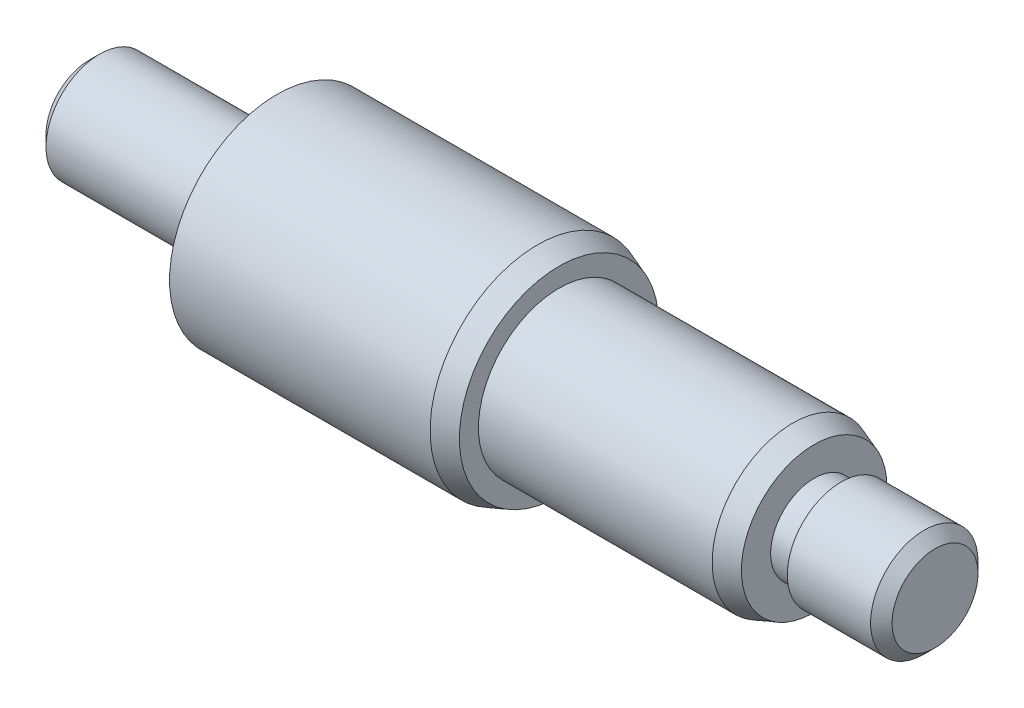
ISO-10303-21;
HEADER;
FILE_DESCRIPTION(('STEP AP214'),'2;1');
FILE_NAME('part.step','',(''),(''),'','','');
FILE_SCHEMA(('AUTOMOTIVE_DESIGN { 1 0 10303 214 1 1 1 1 }'));
ENDSEC;
DATA;
#1=APPLICATION_CONTEXT('core data for automotive mechanical design processes');
#2=APPLICATION_PROTOCOL_DEFINITION('international standard','automotive_design',2000,#1);
#3=PRODUCT_CONTEXT('',#1,'mechanical');
#4=PRODUCT('Part','Part','',(#3));
#5=PRODUCT_RELATED_PRODUCT_CATEGORY('part','',(#4));
#6=PRODUCT_DEFINITION_FORMATION('','',#4);
#7=PRODUCT_DEFINITION_CONTEXT('part definition',#1,'design');
#8=PRODUCT_DEFINITION('design','',#6,#7);
#9=PRODUCT_DEFINITION_SHAPE('','',#8);
#10=(LENGTH_UNIT() NAMED_UNIT(*) SI_UNIT(.MILLI.,.METRE.));
#11=(NAMED_UNIT(*) PLANE_ANGLE_UNIT() SI_UNIT($,.RADIAN.));
#12=(NAMED_UNIT(*) SI_UNIT($,.STERADIAN.) SOLID_ANGLE_UNIT());
#13=UNCERTAINTY_MEASURE_WITH_UNIT(LENGTH_MEASURE(1.E-05),#10,'distance_accuracy_value','');
#14=(GEOMETRIC_REPRESENTATION_CONTEXT(3) GLOBAL_UNCERTAINTY_ASSIGNED_CONTEXT((#13)) GLOBAL_UNIT_ASSIGNED_CONTEXT((#10,
#11,#12)) REPRESENTATION_CONTEXT('',''));
#15=CARTESIAN_POINT('',(0.,0.,0.));
#16=DIRECTION('',(0.,0.,1.));
#17=DIRECTION('',(1.,0.,0.));
#18=AXIS2_PLACEMENT_3D('',#15,#16,#17);
#19=CARTESIAN_POINT('',(0.,0.,0.));
#20=DIRECTION('',(-1.,0.,0.));
#21=DIRECTION('',(0.,0.,1.));
#22=AXIS2_PLACEMENT_3D('',#19,#20,#21);
#23=PLANE('',#22);
#24=CARTESIAN_POINT('',(0.,0.,0.));
#25=DIRECTION('',(-1.,0.,0.));
#26=DIRECTION('',(0.,0.,1.));
#27=AXIS2_PLACEMENT_3D('',#24,#25,#26);
#28=CIRCLE('',#27,1.6);
#29=CARTESIAN_POINT('',(0.,0.,-1.6));
#30=VERTEX_POINT('',#29);
#31=EDGE_CURVE('E358',#30,#30,#28,.T.);
#32=ORIENTED_EDGE('',*,*,#31,.T.);
#33=EDGE_LOOP('',(#32));
#34=FACE_BOUND('',#33,.T.);
#35=ADVANCED_FACE('F348',(#34),#23,.T.);
#36=CARTESIAN_POINT('',(0.,0.,0.));
#37=DIRECTION('',(1.,0.,0.));
#38=DIRECTION('',(0.,0.,-1.));
#39=AXIS2_PLACEMENT_3D('',#36,#37,#38);
#40=CYLINDRICAL_SURFACE('',#39,2.);
#41=CARTESIAN_POINT('',(0.399999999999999,0.,0.));
#42=DIRECTION('',(-1.,0.,0.));
#43=DIRECTION('',(0.,0.,1.));
#44=AXIS2_PLACEMENT_3D('',#41,#42,#43);
#45=CIRCLE('',#44,2.);
#46=CARTESIAN_POINT('',(0.399999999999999,0.,-2.));
#47=VERTEX_POINT('',#46);
#48=EDGE_CURVE('E362',#47,#47,#45,.F.);
#49=ORIENTED_EDGE('',*,*,#48,.T.);
#50=EDGE_LOOP('',(#49));
#51=FACE_BOUND('',#50,.T.);
#52=CARTESIAN_POINT('',(6.,0.,0.));
#53=DIRECTION('',(1.,0.,0.));
#54=DIRECTION('',(0.,0.,-1.));
#55=AXIS2_PLACEMENT_3D('',#52,#53,#54);
#56=CIRCLE('',#55,2.);
#57=CARTESIAN_POINT('',(6.,0.,-2.));
#58=VERTEX_POINT('',#57);
#59=EDGE_CURVE('E367',#58,#58,#56,.T.);
#60=ORIENTED_EDGE('',*,*,#59,.F.);
#61=EDGE_LOOP('',(#60));
#62=FACE_BOUND('',#61,.T.);
#63=ADVANCED_FACE('F421',(#51,#62),#40,.T.);
#64=CARTESIAN_POINT('',(6.,2.,0.));
#65=DIRECTION('',(1.,0.,0.));
#66=DIRECTION('',(0.,0.,-1.));
#67=AXIS2_PLACEMENT_3D('',#64,#65,#66);
#68=PLANE('',#67);
#69=ORIENTED_EDGE('',*,*,#59,.T.);
#70=EDGE_LOOP('',(#69));
#71=FACE_BOUND('',#70,.T.);
#72=CARTESIAN_POINT('',(6.,0.,0.));
#73=DIRECTION('',(1.,0.,0.));
#74=DIRECTION('',(0.,0.,-1.));
#75=AXIS2_PLACEMENT_3D('',#72,#73,#74);
#76=CIRCLE('',#75,1.62);
#77=CARTESIAN_POINT('',(6.,0.,-1.62));
#78=VERTEX_POINT('',#77);
#79=EDGE_CURVE('E370',#78,#78,#76,.T.);
#80=ORIENTED_EDGE('',*,*,#79,.F.);
#81=EDGE_LOOP('',(#80));
#82=FACE_BOUND('',#81,.T.);
#83=ADVANCED_FACE('F426',(#71,#82),#68,.T.);
#84=CARTESIAN_POINT('',(0.,0.,0.));
#85=DIRECTION('',(1.,0.,0.));
#86=DIRECTION('',(0.,0.,-1.));
#87=AXIS2_PLACEMENT_3D('',#84,#85,#86);
#88=CYLINDRICAL_SURFACE('',#87,1.62);
#89=ORIENTED_EDGE('',*,*,#79,.T.);
#90=EDGE_LOOP('',(#89));
#91=FACE_BOUND('',#90,.T.);
#92=CARTESIAN_POINT('',(7.,0.,0.));
#93=DIRECTION('',(1.,0.,0.));
#94=DIRECTION('',(0.,0.,-1.));
#95=AXIS2_PLACEMENT_3D('',#92,#93,#94);
#96=CIRCLE('',#95,1.62);
#97=CARTESIAN_POINT('',(7.,0.,-1.62));
#98=VERTEX_POINT('',#97);
#99=EDGE_CURVE('E373',#98,#98,#96,.T.);
#100=ORIENTED_EDGE('',*,*,#99,.F.);
#101=EDGE_LOOP('',(#100));
#102=FACE_BOUND('',#101,.T.);
#103=ADVANCED_FACE('F441',(#91,#102),#88,.T.);
#104=CARTESIAN_POINT('',(7.,1.62,0.));
#105=DIRECTION('',(-1.,0.,0.));
#106=DIRECTION('',(0.,0.,1.));
#107=AXIS2_PLACEMENT_3D('',#104,#105,#106);
#108=PLANE('',#107);
#109=ORIENTED_EDGE('',*,*,#99,.T.);
#110=EDGE_LOOP('',(#109));
#111=FACE_BOUND('',#110,.T.);
#112=CARTESIAN_POINT('',(7.,0.,0.));
#113=DIRECTION('',(1.,0.,0.));
#114=DIRECTION('',(0.,0.,-1.));
#115=AXIS2_PLACEMENT_3D('',#112,#113,#114);
#116=CIRCLE('',#115,4.);
#117=CARTESIAN_POINT('',(7.,0.,-4.));
#118=VERTEX_POINT('',#117);
#119=EDGE_CURVE('E376',#118,#118,#116,.T.);
#120=ORIENTED_EDGE('',*,*,#119,.F.);
#121=EDGE_LOOP('',(#120));
#122=FACE_BOUND('',#121,.T.);
#123=ADVANCED_FACE('F447',(#111,#122),#108,.T.);
#124=CARTESIAN_POINT('',(0.,0.,0.));
#125=DIRECTION('',(1.,0.,0.));
#126=DIRECTION('',(0.,0.,-1.));
#127=AXIS2_PLACEMENT_3D('',#124,#125,#126);
#128=CYLINDRICAL_SURFACE('',#127,4.);
#129=ORIENTED_EDGE('',*,*,#119,.T.);
#130=EDGE_LOOP('',(#129));
#131=FACE_BOUND('',#130,.T.);
#132=CARTESIAN_POINT('',(16.7,0.,0.));
#133=DIRECTION('',(1.,0.,0.));
#134=DIRECTION('',(0.,0.,-1.));
#135=AXIS2_PLACEMENT_3D('',#132,#133,#134);
#136=CIRCLE('',#135,4.);
#137=CARTESIAN_POINT('',(16.7,0.,-4.));
#138=VERTEX_POINT('',#137);
#139=EDGE_CURVE('E379',#138,#138,#136,.T.);
#140=ORIENTED_EDGE('',*,*,#139,.F.);
#141=EDGE_LOOP('',(#140));
#142=FACE_BOUND('',#141,.T.);
#143=ADVANCED_FACE('F453',(#131,#142),#128,.T.);
#144=CARTESIAN_POINT('',(17.5,0.,0.));
#145=DIRECTION('',(-1.,0.,0.));
#146=DIRECTION('',(0.,0.,1.));
#147=AXIS2_PLACEMENT_3D('',#144,#145,#146);
#148=CONICAL_SURFACE('',#147,3.70882381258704,0.349065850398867);
#149=ORIENTED_EDGE('',*,*,#139,.T.);
#150=EDGE_LOOP('',(#149));
#151=FACE_BOUND('',#150,.T.);
#152=CARTESIAN_POINT('',(17.5,0.,0.));
#153=DIRECTION('',(1.,0.,0.));
#154=DIRECTION('',(0.,0.,-1.));
#155=AXIS2_PLACEMENT_3D('',#152,#153,#154);
#156=CIRCLE('',#155,3.70882381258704);
#157=CARTESIAN_POINT('',(17.5,0.,-3.70882381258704));
#158=VERTEX_POINT('',#157);
#159=EDGE_CURVE('E382',#158,#158,#156,.T.);
#160=ORIENTED_EDGE('',*,*,#159,.F.);
#161=EDGE_LOOP('',(#160));
#162=FACE_BOUND('',#161,.T.);
#163=ADVANCED_FACE('F459',(#151,#162),#148,.T.);
#164=CARTESIAN_POINT('',(17.5,3.70882381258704,0.));
#165=DIRECTION('',(1.,0.,0.));
#166=DIRECTION('',(0.,0.,-1.));
#167=AXIS2_PLACEMENT_3D('',#164,#165,#166);
#168=PLANE('',#167);
#169=ORIENTED_EDGE('',*,*,#159,.T.);
#170=EDGE_LOOP('',(#169));
#171=FACE_BOUND('',#170,.T.);
#172=CARTESIAN_POINT('',(17.5,0.,0.));
#173=DIRECTION('',(1.,0.,0.));
#174=DIRECTION('',(0.,0.,-1.));
#175=AXIS2_PLACEMENT_3D('',#172,#173,#174);
#176=CIRCLE('',#175,3.);
#177=CARTESIAN_POINT('',(17.5,0.,-3.));
#178=VERTEX_POINT('',#177);
#179=EDGE_CURVE('E385',#178,#178,#176,.T.);
#180=ORIENTED_EDGE('',*,*,#179,.F.);
#181=EDGE_LOOP('',(#180));
#182=FACE_BOUND('',#181,.T.);
#183=ADVANCED_FACE('F465',(#171,#182),#168,.T.);
#184=CARTESIAN_POINT('',(0.,0.,0.));
#185=DIRECTION('',(1.,0.,0.));
#186=DIRECTION('',(0.,0.,-1.));
#187=AXIS2_PLACEMENT_3D('',#184,#185,#186);
#188=CYLINDRICAL_SURFACE('',#187,3.);
#189=ORIENTED_EDGE('',*,*,#179,.T.);
#190=EDGE_LOOP('',(#189));
#191=FACE_BOUND('',#190,.T.);
#192=CARTESIAN_POINT('',(26.2,0.,0.));
#193=DIRECTION('',(1.,0.,0.));
#194=DIRECTION('',(0.,0.,-1.));
#195=AXIS2_PLACEMENT_3D('',#192,#193,#194);
#196=CIRCLE('',#195,3.);
#197=CARTESIAN_POINT('',(26.2,0.,-3.));
#198=VERTEX_POINT('',#197);
#199=EDGE_CURVE('E388',#198,#198,#196,.T.);
#200=ORIENTED_EDGE('',*,*,#199,.F.);
#201=EDGE_LOOP('',(#200));
#202=FACE_BOUND('',#201,.T.);
#203=ADVANCED_FACE('F471',(#191,#202),#188,.T.);
#204=CARTESIAN_POINT('',(27.,0.,0.));
#205=DIRECTION('',(-1.,0.,0.));
#206=DIRECTION('',(0.,0.,1.));
#207=AXIS2_PLACEMENT_3D('',#204,#205,#206);
#208=CONICAL_SURFACE('',#207,2.70882381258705,0.34906585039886);
#209=ORIENTED_EDGE('',*,*,#199,.T.);
#210=EDGE_LOOP('',(#209));
#211=FACE_BOUND('',#210,.T.);
#212=CARTESIAN_POINT('',(27.,0.,0.));
#213=DIRECTION('',(1.,0.,0.));
#214=DIRECTION('',(0.,0.,-1.));
#215=AXIS2_PLACEMENT_3D('',#212,#213,#214);
#216=CIRCLE('',#215,2.70882381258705);
#217=CARTESIAN_POINT('',(27.,0.,-2.70882381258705));
#218=VERTEX_POINT('',#217);
#219=EDGE_CURVE('E391',#218,#218,#216,.T.);
#220=ORIENTED_EDGE('',*,*,#219,.F.);
#221=EDGE_LOOP('',(#220));
#222=FACE_BOUND('',#221,.T.);
#223=ADVANCED_FACE('F477',(#211,#222),#208,.T.);
#224=CARTESIAN_POINT('',(27.,1.62,0.));
#225=DIRECTION('',(1.,0.,0.));
#226=DIRECTION('',(0.,0.,-1.));
#227=AXIS2_PLACEMENT_3D('',#224,#225,#226);
#228=PLANE('',#227);
#229=ORIENTED_EDGE('',*,*,#219,.T.);
#230=EDGE_LOOP('',(#229));
#231=FACE_BOUND('',#230,.T.);
#232=CARTESIAN_POINT('',(27.,0.,0.));
#233=DIRECTION('',(1.,0.,0.));
#234=DIRECTION('',(0.,0.,-1.));
#235=AXIS2_PLACEMENT_3D('',#232,#233,#234);
#236=CIRCLE('',#235,1.62);
#237=CARTESIAN_POINT('',(27.,0.,-1.62));
#238=VERTEX_POINT('',#237);
#239=EDGE_CURVE('E394',#238,#238,#236,.T.);
#240=ORIENTED_EDGE('',*,*,#239,.F.);
#241=EDGE_LOOP('',(#240));
#242=FACE_BOUND('',#241,.T.);
#243=ADVANCED_FACE('F417',(#231,#242),#228,.T.);
#244=CARTESIAN_POINT('',(0.,0.,0.));
#245=DIRECTION('',(1.,0.,0.));
#246=DIRECTION('',(0.,0.,-1.));
#247=AXIS2_PLACEMENT_3D('',#244,#245,#246);
#248=CYLINDRICAL_SURFACE('',#247,1.62);
#249=ORIENTED_EDGE('',*,*,#239,.T.);
#250=EDGE_LOOP('',(#249));
#251=FACE_BOUND('',#250,.T.);
#252=CARTESIAN_POINT('',(28.,0.,0.));
#253=DIRECTION('',(1.,0.,0.));
#254=DIRECTION('',(0.,0.,-1.));
#255=AXIS2_PLACEMENT_3D('',#252,#253,#254);
#256=CIRCLE('',#255,1.62);
#257=CARTESIAN_POINT('',(28.,0.,-1.62));
#258=VERTEX_POINT('',#257);
#259=EDGE_CURVE('E397',#258,#258,#256,.T.);
#260=ORIENTED_EDGE('',*,*,#259,.F.);
#261=EDGE_LOOP('',(#260));
#262=FACE_BOUND('',#261,.T.);
#263=ADVANCED_FACE('F408',(#251,#262),#248,.T.);
#264=CARTESIAN_POINT('',(28.,1.62,0.));
#265=DIRECTION('',(-1.,0.,0.));
#266=DIRECTION('',(0.,0.,1.));
#267=AXIS2_PLACEMENT_3D('',#264,#265,#266);
#268=PLANE('',#267);
#269=ORIENTED_EDGE('',*,*,#259,.T.);
#270=EDGE_LOOP('',(#269));
#271=FACE_BOUND('',#270,.T.);
#272=CARTESIAN_POINT('',(28.,0.,0.));
#273=DIRECTION('',(1.,0.,0.));
#274=DIRECTION('',(0.,0.,-1.));
#275=AXIS2_PLACEMENT_3D('',#272,#273,#274);
#276=CIRCLE('',#275,2.);
#277=CARTESIAN_POINT('',(28.,0.,-2.));
#278=VERTEX_POINT('',#277);
#279=EDGE_CURVE('E400',#278,#278,#276,.T.);
#280=ORIENTED_EDGE('',*,*,#279,.F.);
#281=EDGE_LOOP('',(#280));
#282=FACE_BOUND('',#281,.T.);
#283=ADVANCED_FACE('F406',(#271,#282),#268,.T.);
#284=CARTESIAN_POINT('',(0.,0.,0.));
#285=DIRECTION('',(1.,0.,0.));
#286=DIRECTION('',(0.,0.,-1.));
#287=AXIS2_PLACEMENT_3D('',#284,#285,#286);
#288=CYLINDRICAL_SURFACE('',#287,2.);
#289=CARTESIAN_POINT('',(31.1,0.,0.));
#290=DIRECTION('',(1.,0.,0.));
#291=DIRECTION('',(0.,0.,-1.));
#292=AXIS2_PLACEMENT_3D('',#289,#290,#291);
#293=CIRCLE('',#292,2.);
#294=CARTESIAN_POINT('',(31.1,0.,-2.));
#295=VERTEX_POINT('',#294);
#296=EDGE_CURVE('E10',#295,#295,#293,.F.);
#297=ORIENTED_EDGE('',*,*,#296,.T.);
#298=EDGE_LOOP('',(#297));
#299=FACE_BOUND('',#298,.T.);
#300=ORIENTED_EDGE('',*,*,#279,.T.);
#301=EDGE_LOOP('',(#300));
#302=FACE_BOUND('',#301,.T.);
#303=ADVANCED_FACE('F404',(#299,#302),#288,.T.);
#304=CARTESIAN_POINT('',(31.5,2.00000000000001,0.));
#305=DIRECTION('',(1.,0.,0.));
#306=DIRECTION('',(0.,0.,-1.));
#307=AXIS2_PLACEMENT_3D('',#304,#305,#306);
#308=PLANE('',#307);
#309=CARTESIAN_POINT('',(31.5,0.,0.));
#310=DIRECTION('',(1.,0.,0.));
#311=DIRECTION('',(0.,0.,-1.));
#312=AXIS2_PLACEMENT_3D('',#309,#310,#311);
#313=CIRCLE('',#312,1.60000000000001);
#314=CARTESIAN_POINT('',(31.5,0.,-1.60000000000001));
#315=VERTEX_POINT('',#314);
#316=EDGE_CURVE('E354',#315,#315,#313,.T.);
#317=ORIENTED_EDGE('',*,*,#316,.T.);
#318=EDGE_LOOP('',(#317));
#319=FACE_BOUND('',#318,.T.);
#320=ADVANCED_FACE('F415',(#319),#308,.T.);
#321=CARTESIAN_POINT('',(0.399999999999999,0.,0.));
#322=DIRECTION('',(1.,0.,0.));
#323=DIRECTION('',(0.,0.,-1.));
#324=AXIS2_PLACEMENT_3D('',#321,#322,#323);
#325=CONICAL_SURFACE('',#324,2.,0.78539816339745);
#326=CARTESIAN_POINT('',(0.,0.,-1.6));
#327=CARTESIAN_POINT('',(0.00416666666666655,0.,-1.60416666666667));
#328=CARTESIAN_POINT('',(0.00833333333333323,0.,-1.60833333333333));
#329=CARTESIAN_POINT('',(0.0166666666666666,0.,-1.61666666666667));
#330=CARTESIAN_POINT('',(0.0208333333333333,0.,-1.62083333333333));
#331=CARTESIAN_POINT('',(0.0291666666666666,0.,-1.62916666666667));
#332=CARTESIAN_POINT('',(0.0333333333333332,0.,-1.63333333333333));
#333=CARTESIAN_POINT('',(0.0416666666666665,0.,-1.64166666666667));
#334=CARTESIAN_POINT('',(0.0458333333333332,0.,-1.64583333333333));
#335=CARTESIAN_POINT('',(0.0541666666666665,0.,-1.65416666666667));
#336=CARTESIAN_POINT('',(0.0583333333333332,0.,-1.65833333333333));
#337=CARTESIAN_POINT('',(0.0666666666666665,0.,-1.66666666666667));
#338=CARTESIAN_POINT('',(0.0708333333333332,0.,-1.67083333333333));
#339=CARTESIAN_POINT('',(0.0791666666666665,0.,-1.67916666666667));
#340=CARTESIAN_POINT('',(0.0833333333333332,0.,-1.68333333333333));
#341=CARTESIAN_POINT('',(0.0916666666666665,0.,-1.69166666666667));
#342=CARTESIAN_POINT('',(0.0958333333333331,0.,-1.69583333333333));
#343=CARTESIAN_POINT('',(0.104166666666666,0.,-1.70416666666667));
#344=CARTESIAN_POINT('',(0.108333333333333,0.,-1.70833333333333));
#345=CARTESIAN_POINT('',(0.116666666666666,0.,-1.71666666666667));
#346=CARTESIAN_POINT('',(0.120833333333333,0.,-1.72083333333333));
#347=CARTESIAN_POINT('',(0.129166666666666,0.,-1.72916666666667));
#348=CARTESIAN_POINT('',(0.133333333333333,0.,-1.73333333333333));
#349=CARTESIAN_POINT('',(0.141666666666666,0.,-1.74166666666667));
#350=CARTESIAN_POINT('',(0.145833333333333,0.,-1.74583333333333));
#351=CARTESIAN_POINT('',(0.154166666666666,0.,-1.75416666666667));
#352=CARTESIAN_POINT('',(0.158333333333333,0.,-1.75833333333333));
#353=CARTESIAN_POINT('',(0.166666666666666,0.,-1.76666666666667));
#354=CARTESIAN_POINT('',(0.170833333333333,0.,-1.77083333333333));
#355=CARTESIAN_POINT('',(0.179166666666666,0.,-1.77916666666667));
#356=CARTESIAN_POINT('',(0.183333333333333,0.,-1.78333333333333));
#357=CARTESIAN_POINT('',(0.191666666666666,0.,-1.79166666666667));
#358=CARTESIAN_POINT('',(0.195833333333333,0.,-1.79583333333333));
#359=CARTESIAN_POINT('',(0.204166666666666,0.,-1.80416666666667));
#360=CARTESIAN_POINT('',(0.208333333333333,0.,-1.80833333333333));
#361=CARTESIAN_POINT('',(0.216666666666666,0.,-1.81666666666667));
#362=CARTESIAN_POINT('',(0.220833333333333,0.,-1.82083333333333));
#363=CARTESIAN_POINT('',(0.229166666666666,0.,-1.82916666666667));
#364=CARTESIAN_POINT('',(0.233333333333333,0.,-1.83333333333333));
#365=CARTESIAN_POINT('',(0.241666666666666,0.,-1.84166666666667));
#366=CARTESIAN_POINT('',(0.245833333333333,0.,-1.84583333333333));
#367=CARTESIAN_POINT('',(0.254166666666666,0.,-1.85416666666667));
#368=CARTESIAN_POINT('',(0.258333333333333,0.,-1.85833333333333));
#369=CARTESIAN_POINT('',(0.266666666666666,0.,-1.86666666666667));
#370=CARTESIAN_POINT('',(0.270833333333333,0.,-1.87083333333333));
#371=CARTESIAN_POINT('',(0.279166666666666,0.,-1.87916666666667));
#372=CARTESIAN_POINT('',(0.283333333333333,0.,-1.88333333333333));
#373=CARTESIAN_POINT('',(0.291666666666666,0.,-1.89166666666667));
#374=CARTESIAN_POINT('',(0.295833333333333,0.,-1.89583333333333));
#375=CARTESIAN_POINT('',(0.304166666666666,0.,-1.90416666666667));
#376=CARTESIAN_POINT('',(0.308333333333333,0.,-1.90833333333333));
#377=CARTESIAN_POINT('',(0.316666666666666,0.,-1.91666666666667));
#378=CARTESIAN_POINT('',(0.320833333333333,0.,-1.92083333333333));
#379=CARTESIAN_POINT('',(0.329166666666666,0.,-1.92916666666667));
#380=CARTESIAN_POINT('',(0.333333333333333,0.,-1.93333333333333));
#381=CARTESIAN_POINT('',(0.341666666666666,0.,-1.94166666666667));
#382=CARTESIAN_POINT('',(0.345833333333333,0.,-1.94583333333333));
#383=CARTESIAN_POINT('',(0.354166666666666,0.,-1.95416666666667));
#384=CARTESIAN_POINT('',(0.358333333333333,0.,-1.95833333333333));
#385=CARTESIAN_POINT('',(0.366666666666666,0.,-1.96666666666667));
#386=CARTESIAN_POINT('',(0.370833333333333,0.,-1.97083333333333));
#387=CARTESIAN_POINT('',(0.379166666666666,0.,-1.97916666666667));
#388=CARTESIAN_POINT('',(0.383333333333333,0.,-1.98333333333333));
#389=CARTESIAN_POINT('',(0.391666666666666,0.,-1.99166666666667));
#390=CARTESIAN_POINT('',(0.395833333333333,0.,-1.99583333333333));
#391=CARTESIAN_POINT('',(0.399999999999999,0.,-2.));
#392=B_SPLINE_CURVE_WITH_KNOTS('',3,(#326,#327,#328,#329,#330,#331,#332,#333,#334,#335,#336,
#337,#338,#339,#340,#341,#342,#343,#344,#345,#346,#347,#348,#349,#350,#351,#352,#353,#354,#355,
#356,#357,#358,#359,#360,#361,#362,#363,#364,#365,#366,#367,#368,#369,#370,#371,#372,#373,#374,
#375,#376,#377,#378,#379,#380,#381,#382,#383,#384,#385,#386,#387,#388,#389,#390,#391),
.UNSPECIFIED.,.F.,.F.,(4,2,2,2,2,2,2,2,2,2,2,2,2,2,2,2,2,2,2,2,2,2,2,2,2,2,2,2,2,2,2,2,4),(0.,
0.0176776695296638,0.0353553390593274,0.0530330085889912,0.0707106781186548,0.0883883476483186,
0.106066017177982,0.123743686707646,0.14142135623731,0.159099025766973,0.176776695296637,
0.194454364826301,0.212132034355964,0.229809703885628,0.247487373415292,0.265165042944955,
0.282842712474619,0.300520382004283,0.318198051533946,0.33587572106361,0.353553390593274,
0.371231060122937,0.388908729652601,0.406586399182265,0.424264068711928,0.441941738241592,
0.459619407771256,0.47729707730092,0.494974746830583,0.512652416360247,0.53033008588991,
0.548007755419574,0.565685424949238),.UNSPECIFIED.);
#393=EDGE_CURVE('BSEAM430',#30,#47,#392,.T.);
#394=ORIENTED_EDGE('',*,*,#31,.F.);
#395=ORIENTED_EDGE('',*,*,#48,.F.);
#396=ORIENTED_EDGE('',*,*,#393,.T.);
#397=ORIENTED_EDGE('',*,*,#393,.F.);
#398=EDGE_LOOP('',(#394,#396,#395,#397));
#399=FACE_BOUND('',#398,.T.);
#400=ADVANCED_FACE('F430',(#399),#325,.T.);
#401=CARTESIAN_POINT('',(31.5,0.,0.));
#402=DIRECTION('',(-1.,0.,0.));
#403=DIRECTION('',(0.,0.,1.));
#404=AXIS2_PLACEMENT_3D('',#401,#402,#403);
#405=CONICAL_SURFACE('',#404,1.60000000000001,0.785398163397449);
#406=ORIENTED_EDGE('',*,*,#296,.F.);
#407=EDGE_LOOP('',(#406));
#408=FACE_BOUND('',#407,.T.);
#409=ORIENTED_EDGE('',*,*,#316,.F.);
#410=EDGE_LOOP('',(#409));
#411=FACE_BOUND('',#410,.T.);
#412=ADVANCED_FACE('F433',(#408,#411),#405,.T.);
#413=CLOSED_SHELL('',(#35,#63,#83,#103,#123,#143,#163,#183,#203,#223,#243,#263,#283,#303,#320,
#400,#412));
#414=MANIFOLD_SOLID_BREP('B2',#413);
#415=ADVANCED_BREP_SHAPE_REPRESENTATION('',(#18,#414),#14);
#416=SHAPE_DEFINITION_REPRESENTATION(#9,#415);
ENDSEC;
END-ISO-10303-21;
